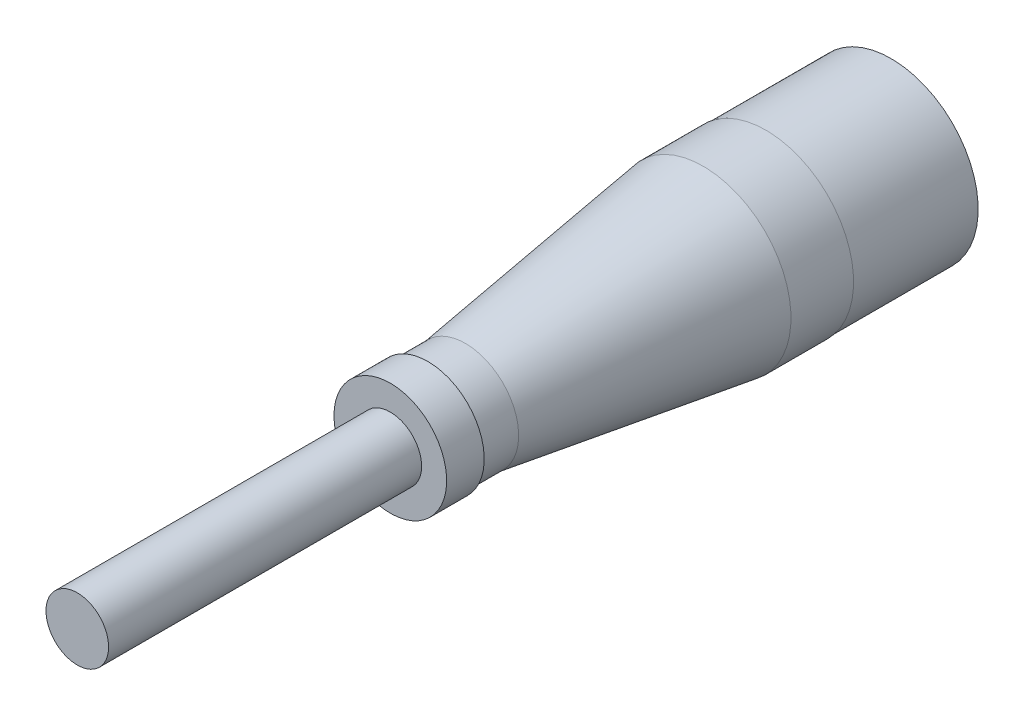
from build123d import *

# Parameters (mm, degrees)
ESQUISSE1_R             = 6.95
EXTRUSION1_DEPTH        = 10
ESQUISSE2_R             = 7
EXTRUSION2_DEPTH        = 5
ESQUISSE4_R             = 2.5
EXTRUSION3_DEPTH        = 25
ESQUISSE5_R             = 6
ENL_V_MAT_EXTRU_1_DEPTH = 9


with BuildPart() as part:
    # Esquisse1 → Extrusion1 (new body)
    with BuildSketch(Plane.XY):
        Circle(ESQUISSE1_R)
    extrude(amount=EXTRUSION1_DEPTH)

    # Esquisse2 → Extrusion2 (add)
    with BuildSketch(Plane.XY.offset(10)):
        Circle(ESQUISSE2_R)
    extrude(amount=EXTRUSION2_DEPTH)

    # Esquisse3 → R_volution1 (revolve)
    with BuildSketch(Plane(origin=(-25, 0, 25), x_dir=(-1, 0, 0), z_dir=(0, 1, 0)), mode=Mode.PRIVATE) as r_volution1_sk:
        Polygon((-25, -10), (-25, 15), (-29.5, 15), (-29.5, 12), (-29.25, 12), (-29.25, 9), (-32, -10), align=None)
    revolve(r_volution1_sk.sketch.rotate(Axis((0, 0, 15), (0, 0, 1)), 180), axis=Axis((0, 0, 15), (0, 0, 1)))

    # Esquisse4 → Extrusion3 (add)
    with BuildSketch(Plane(origin=(0, 0, 40), x_dir=(-1, 0, 0), z_dir=(0, 0, 1))):
        Circle(ESQUISSE4_R)
    extrude(amount=EXTRUSION3_DEPTH)

    # Esquisse5 → Enl_v. mat.-Extru.1 (cut)
    with BuildSketch(Plane(origin=(0, 0, 0), x_dir=(-1, 0, 0), z_dir=(0, 0, -1))):
        Circle(ESQUISSE5_R)
    extrude(amount=-ENL_V_MAT_EXTRU_1_DEPTH, mode=Mode.SUBTRACT)


solid = part.part
